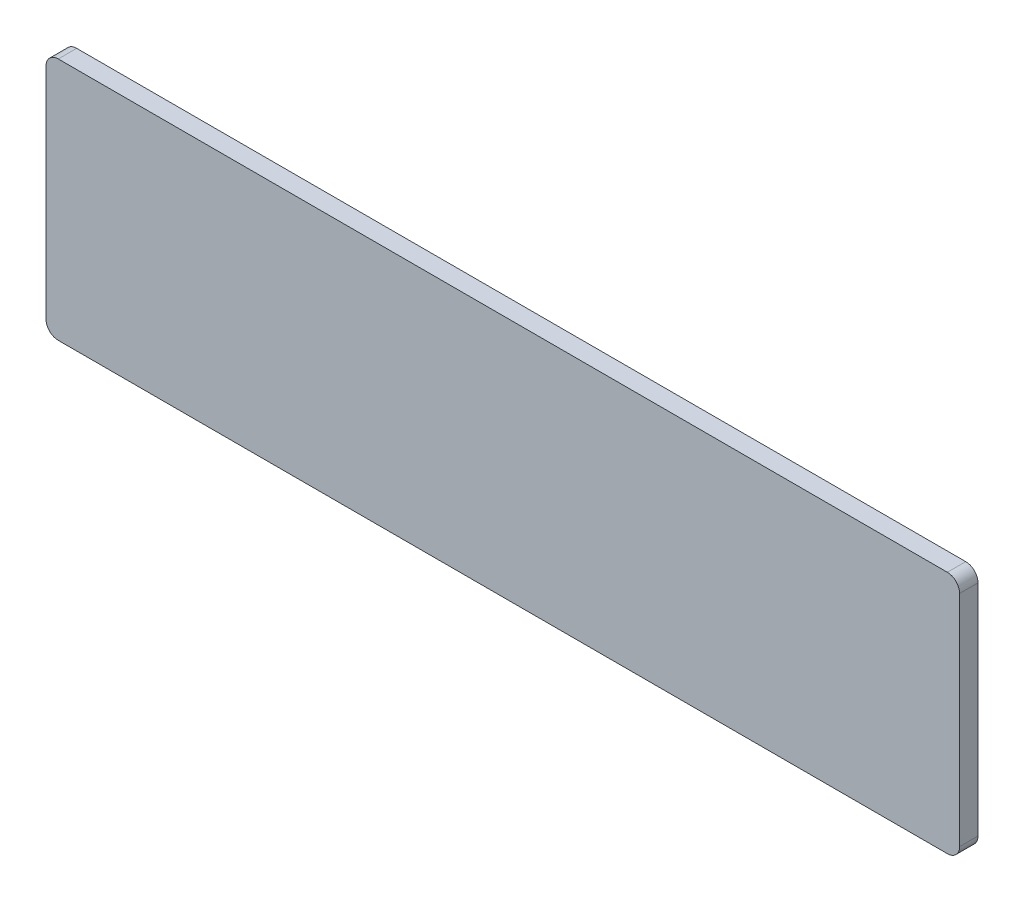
ISO-10303-21;
HEADER;
FILE_DESCRIPTION(('STEP AP214'),'2;1');
FILE_NAME('part.step','',(''),(''),'','','');
FILE_SCHEMA(('AUTOMOTIVE_DESIGN { 1 0 10303 214 1 1 1 1 }'));
ENDSEC;
DATA;
#1=APPLICATION_CONTEXT('core data for automotive mechanical design processes');
#2=APPLICATION_PROTOCOL_DEFINITION('international standard','automotive_design',2000,#1);
#3=PRODUCT_CONTEXT('',#1,'mechanical');
#4=PRODUCT('Part','Part','',(#3));
#5=PRODUCT_RELATED_PRODUCT_CATEGORY('part','',(#4));
#6=PRODUCT_DEFINITION_FORMATION('','',#4);
#7=PRODUCT_DEFINITION_CONTEXT('part definition',#1,'design');
#8=PRODUCT_DEFINITION('design','',#6,#7);
#9=PRODUCT_DEFINITION_SHAPE('','',#8);
#10=(LENGTH_UNIT() NAMED_UNIT(*) SI_UNIT(.MILLI.,.METRE.));
#11=(NAMED_UNIT(*) PLANE_ANGLE_UNIT() SI_UNIT($,.RADIAN.));
#12=(NAMED_UNIT(*) SI_UNIT($,.STERADIAN.) SOLID_ANGLE_UNIT());
#13=UNCERTAINTY_MEASURE_WITH_UNIT(LENGTH_MEASURE(1.E-05),#10,'distance_accuracy_value','');
#14=(GEOMETRIC_REPRESENTATION_CONTEXT(3) GLOBAL_UNCERTAINTY_ASSIGNED_CONTEXT((#13)) GLOBAL_UNIT_ASSIGNED_CONTEXT((#10,
#11,#12)) REPRESENTATION_CONTEXT('',''));
#15=CARTESIAN_POINT('',(0.,0.,0.));
#16=DIRECTION('',(0.,0.,1.));
#17=DIRECTION('',(1.,0.,0.));
#18=AXIS2_PLACEMENT_3D('',#15,#16,#17);
#19=CARTESIAN_POINT('',(-74.5,-19.875,3.));
#20=DIRECTION('',(1.,0.,0.));
#21=DIRECTION('',(0.,0.,-1.));
#22=AXIS2_PLACEMENT_3D('',#19,#20,#21);
#23=PLANE('',#22);
#24=DIRECTION('',(0.,-1.,0.));
#25=VECTOR('',#24,1.);
#26=CARTESIAN_POINT('',(-74.5,-19.875,0.));
#27=LINE('',#26,#25);
#28=CARTESIAN_POINT('',(-74.5,17.875,0.));
#29=VERTEX_POINT('',#28);
#30=CARTESIAN_POINT('',(-74.5,-17.875,0.));
#31=VERTEX_POINT('',#30);
#32=EDGE_CURVE('E142',#29,#31,#27,.T.);
#33=ORIENTED_EDGE('',*,*,#32,.T.);
#34=DIRECTION('',(0.,0.,-1.));
#35=VECTOR('',#34,1.);
#36=CARTESIAN_POINT('',(-74.5,-17.875,3.));
#37=LINE('',#36,#35);
#38=CARTESIAN_POINT('',(-74.5,-17.875,3.));
#39=VERTEX_POINT('',#38);
#40=EDGE_CURVE('E116',#31,#39,#37,.F.);
#41=ORIENTED_EDGE('',*,*,#40,.T.);
#42=DIRECTION('',(0.,-1.,0.));
#43=VECTOR('',#42,1.);
#44=CARTESIAN_POINT('',(-74.5,-19.875,3.));
#45=LINE('',#44,#43);
#46=CARTESIAN_POINT('',(-74.5,17.875,3.));
#47=VERTEX_POINT('',#46);
#48=EDGE_CURVE('E154',#47,#39,#45,.T.);
#49=ORIENTED_EDGE('',*,*,#48,.F.);
#50=DIRECTION('',(0.,0.,-1.));
#51=VECTOR('',#50,1.);
#52=CARTESIAN_POINT('',(-74.5,17.875,3.));
#53=LINE('',#52,#51);
#54=EDGE_CURVE('E122',#47,#29,#53,.T.);
#55=ORIENTED_EDGE('',*,*,#54,.T.);
#56=EDGE_LOOP('',(#33,#41,#49,#55));
#57=FACE_BOUND('',#56,.T.);
#58=ADVANCED_FACE('F43',(#57),#23,.F.);
#59=CARTESIAN_POINT('',(74.5,-19.875,3.));
#60=DIRECTION('',(0.,1.,0.));
#61=DIRECTION('',(-1.,0.,0.));
#62=AXIS2_PLACEMENT_3D('',#59,#60,#61);
#63=PLANE('',#62);
#64=DIRECTION('',(1.,0.,0.));
#65=VECTOR('',#64,1.);
#66=CARTESIAN_POINT('',(74.5,-19.875,3.));
#67=LINE('',#66,#65);
#68=CARTESIAN_POINT('',(-72.5,-19.875,3.));
#69=VERTEX_POINT('',#68);
#70=CARTESIAN_POINT('',(72.5,-19.875,3.));
#71=VERTEX_POINT('',#70);
#72=EDGE_CURVE('E132',#69,#71,#67,.T.);
#73=ORIENTED_EDGE('',*,*,#72,.F.);
#74=DIRECTION('',(0.,0.,-1.));
#75=VECTOR('',#74,1.);
#76=CARTESIAN_POINT('',(-72.5,-19.875,3.));
#77=LINE('',#76,#75);
#78=CARTESIAN_POINT('',(-72.5,-19.875,0.));
#79=VERTEX_POINT('',#78);
#80=EDGE_CURVE('E115',#69,#79,#77,.T.);
#81=ORIENTED_EDGE('',*,*,#80,.T.);
#82=DIRECTION('',(1.,0.,0.));
#83=VECTOR('',#82,1.);
#84=CARTESIAN_POINT('',(74.5,-19.875,0.));
#85=LINE('',#84,#83);
#86=CARTESIAN_POINT('',(72.5,-19.875,0.));
#87=VERTEX_POINT('',#86);
#88=EDGE_CURVE('E129',#79,#87,#85,.T.);
#89=ORIENTED_EDGE('',*,*,#88,.T.);
#90=DIRECTION('',(0.,0.,-1.));
#91=VECTOR('',#90,1.);
#92=CARTESIAN_POINT('',(72.5,-19.875,3.));
#93=LINE('',#92,#91);
#94=EDGE_CURVE('E135',#87,#71,#93,.F.);
#95=ORIENTED_EDGE('',*,*,#94,.T.);
#96=EDGE_LOOP('',(#73,#81,#89,#95));
#97=FACE_BOUND('',#96,.T.);
#98=ADVANCED_FACE('F128',(#97),#63,.F.);
#99=CARTESIAN_POINT('',(74.5,-19.875,3.));
#100=DIRECTION('',(-1.,0.,0.));
#101=DIRECTION('',(0.,0.,1.));
#102=AXIS2_PLACEMENT_3D('',#99,#100,#101);
#103=PLANE('',#102);
#104=DIRECTION('',(0.,1.,0.));
#105=VECTOR('',#104,1.);
#106=CARTESIAN_POINT('',(74.5,-19.875,3.));
#107=LINE('',#106,#105);
#108=CARTESIAN_POINT('',(74.5,-17.875,3.));
#109=VERTEX_POINT('',#108);
#110=CARTESIAN_POINT('',(74.5,17.875,3.));
#111=VERTEX_POINT('',#110);
#112=EDGE_CURVE('E190',#109,#111,#107,.T.);
#113=ORIENTED_EDGE('',*,*,#112,.F.);
#114=DIRECTION('',(0.,0.,-1.));
#115=VECTOR('',#114,1.);
#116=CARTESIAN_POINT('',(74.5,-17.875,3.));
#117=LINE('',#116,#115);
#118=CARTESIAN_POINT('',(74.5,-17.875,0.));
#119=VERTEX_POINT('',#118);
#120=EDGE_CURVE('E11',#109,#119,#117,.T.);
#121=ORIENTED_EDGE('',*,*,#120,.T.);
#122=DIRECTION('',(0.,1.,0.));
#123=VECTOR('',#122,1.);
#124=CARTESIAN_POINT('',(74.5,-19.875,0.));
#125=LINE('',#124,#123);
#126=CARTESIAN_POINT('',(74.5,17.875,0.));
#127=VERTEX_POINT('',#126);
#128=EDGE_CURVE('E141',#119,#127,#125,.T.);
#129=ORIENTED_EDGE('',*,*,#128,.T.);
#130=DIRECTION('',(0.,0.,-1.));
#131=VECTOR('',#130,1.);
#132=CARTESIAN_POINT('',(74.5,17.875,3.));
#133=LINE('',#132,#131);
#134=EDGE_CURVE('E52',#127,#111,#133,.F.);
#135=ORIENTED_EDGE('',*,*,#134,.T.);
#136=EDGE_LOOP('',(#113,#121,#129,#135));
#137=FACE_BOUND('',#136,.T.);
#138=ADVANCED_FACE('F189',(#137),#103,.F.);
#139=CARTESIAN_POINT('',(74.5,19.875,3.));
#140=DIRECTION('',(0.,-1.,0.));
#141=DIRECTION('',(1.,0.,0.));
#142=AXIS2_PLACEMENT_3D('',#139,#140,#141);
#143=PLANE('',#142);
#144=DIRECTION('',(-1.,0.,0.));
#145=VECTOR('',#144,1.);
#146=CARTESIAN_POINT('',(74.5,19.875,0.));
#147=LINE('',#146,#145);
#148=CARTESIAN_POINT('',(72.5,19.875,0.));
#149=VERTEX_POINT('',#148);
#150=CARTESIAN_POINT('',(-72.5,19.875,0.));
#151=VERTEX_POINT('',#150);
#152=EDGE_CURVE('E147',#149,#151,#147,.T.);
#153=ORIENTED_EDGE('',*,*,#152,.T.);
#154=DIRECTION('',(0.,0.,-1.));
#155=VECTOR('',#154,1.);
#156=CARTESIAN_POINT('',(-72.5,19.875,3.));
#157=LINE('',#156,#155);
#158=CARTESIAN_POINT('',(-72.5,19.875,3.));
#159=VERTEX_POINT('',#158);
#160=EDGE_CURVE('E59',#151,#159,#157,.F.);
#161=ORIENTED_EDGE('',*,*,#160,.T.);
#162=DIRECTION('',(-1.,0.,0.));
#163=VECTOR('',#162,1.);
#164=CARTESIAN_POINT('',(74.5,19.875,3.));
#165=LINE('',#164,#163);
#166=CARTESIAN_POINT('',(72.5,19.875,3.));
#167=VERTEX_POINT('',#166);
#168=EDGE_CURVE('E156',#167,#159,#165,.T.);
#169=ORIENTED_EDGE('',*,*,#168,.F.);
#170=DIRECTION('',(0.,0.,-1.));
#171=VECTOR('',#170,1.);
#172=CARTESIAN_POINT('',(72.5,19.875,3.));
#173=LINE('',#172,#171);
#174=EDGE_CURVE('E180',#167,#149,#173,.T.);
#175=ORIENTED_EDGE('',*,*,#174,.T.);
#176=EDGE_LOOP('',(#153,#161,#169,#175));
#177=FACE_BOUND('',#176,.T.);
#178=ADVANCED_FACE('F200',(#177),#143,.F.);
#179=CARTESIAN_POINT('',(0.,0.,3.));
#180=DIRECTION('',(0.,0.,1.));
#181=DIRECTION('',(1.,0.,0.));
#182=AXIS2_PLACEMENT_3D('',#179,#180,#181);
#183=PLANE('',#182);
#184=ORIENTED_EDGE('',*,*,#48,.T.);
#185=CARTESIAN_POINT('',(-72.5,-17.875,3.));
#186=DIRECTION('',(0.,0.,1.));
#187=DIRECTION('',(1.,0.,0.));
#188=AXIS2_PLACEMENT_3D('',#185,#186,#187);
#189=CIRCLE('',#188,2.);
#190=EDGE_CURVE('E177',#39,#69,#189,.T.);
#191=ORIENTED_EDGE('',*,*,#190,.T.);
#192=ORIENTED_EDGE('',*,*,#72,.T.);
#193=CARTESIAN_POINT('',(72.5,-17.875,3.));
#194=DIRECTION('',(0.,0.,1.));
#195=DIRECTION('',(1.,0.,0.));
#196=AXIS2_PLACEMENT_3D('',#193,#194,#195);
#197=CIRCLE('',#196,2.);
#198=EDGE_CURVE('E171',#71,#109,#197,.T.);
#199=ORIENTED_EDGE('',*,*,#198,.T.);
#200=ORIENTED_EDGE('',*,*,#112,.T.);
#201=CARTESIAN_POINT('',(72.5,17.875,3.));
#202=DIRECTION('',(0.,0.,1.));
#203=DIRECTION('',(1.,0.,0.));
#204=AXIS2_PLACEMENT_3D('',#201,#202,#203);
#205=CIRCLE('',#204,2.);
#206=EDGE_CURVE('E66',#111,#167,#205,.T.);
#207=ORIENTED_EDGE('',*,*,#206,.T.);
#208=ORIENTED_EDGE('',*,*,#168,.T.);
#209=CARTESIAN_POINT('',(-72.5,17.875,3.));
#210=DIRECTION('',(0.,0.,1.));
#211=DIRECTION('',(1.,0.,0.));
#212=AXIS2_PLACEMENT_3D('',#209,#210,#211);
#213=CIRCLE('',#212,2.);
#214=EDGE_CURVE('E174',#159,#47,#213,.T.);
#215=ORIENTED_EDGE('',*,*,#214,.T.);
#216=EDGE_LOOP('',(#184,#191,#192,#199,#200,#207,#208,#215));
#217=FACE_BOUND('',#216,.T.);
#218=ADVANCED_FACE('F194',(#217),#183,.T.);
#219=CARTESIAN_POINT('',(0.,0.,0.));
#220=DIRECTION('',(0.,0.,1.));
#221=DIRECTION('',(1.,0.,0.));
#222=AXIS2_PLACEMENT_3D('',#219,#220,#221);
#223=PLANE('',#222);
#224=ORIENTED_EDGE('',*,*,#88,.F.);
#225=CARTESIAN_POINT('',(-72.5,-17.875,0.));
#226=DIRECTION('',(0.,0.,1.));
#227=DIRECTION('',(1.,0.,0.));
#228=AXIS2_PLACEMENT_3D('',#225,#226,#227);
#229=CIRCLE('',#228,2.);
#230=EDGE_CURVE('E111',#79,#31,#229,.F.);
#231=ORIENTED_EDGE('',*,*,#230,.T.);
#232=ORIENTED_EDGE('',*,*,#32,.F.);
#233=CARTESIAN_POINT('',(-72.5,17.875,0.));
#234=DIRECTION('',(0.,0.,1.));
#235=DIRECTION('',(1.,0.,0.));
#236=AXIS2_PLACEMENT_3D('',#233,#234,#235);
#237=CIRCLE('',#236,2.);
#238=EDGE_CURVE('E123',#29,#151,#237,.F.);
#239=ORIENTED_EDGE('',*,*,#238,.T.);
#240=ORIENTED_EDGE('',*,*,#152,.F.);
#241=CARTESIAN_POINT('',(72.5,17.875,0.));
#242=DIRECTION('',(0.,0.,1.));
#243=DIRECTION('',(1.,0.,0.));
#244=AXIS2_PLACEMENT_3D('',#241,#242,#243);
#245=CIRCLE('',#244,2.);
#246=EDGE_CURVE('E134',#149,#127,#245,.F.);
#247=ORIENTED_EDGE('',*,*,#246,.T.);
#248=ORIENTED_EDGE('',*,*,#128,.F.);
#249=CARTESIAN_POINT('',(72.5,-17.875,0.));
#250=DIRECTION('',(0.,0.,1.));
#251=DIRECTION('',(1.,0.,0.));
#252=AXIS2_PLACEMENT_3D('',#249,#250,#251);
#253=CIRCLE('',#252,2.);
#254=EDGE_CURVE('E139',#119,#87,#253,.F.);
#255=ORIENTED_EDGE('',*,*,#254,.T.);
#256=EDGE_LOOP('',(#224,#231,#232,#239,#240,#247,#248,#255));
#257=FACE_BOUND('',#256,.T.);
#258=ADVANCED_FACE('F137',(#257),#223,.F.);
#259=CARTESIAN_POINT('',(-72.5,-17.875,3.));
#260=DIRECTION('',(0.,0.,-1.));
#261=DIRECTION('',(-1.,0.,0.));
#262=AXIS2_PLACEMENT_3D('',#259,#260,#261);
#263=CYLINDRICAL_SURFACE('',#262,2.);
#264=ORIENTED_EDGE('',*,*,#190,.F.);
#265=ORIENTED_EDGE('',*,*,#40,.F.);
#266=ORIENTED_EDGE('',*,*,#230,.F.);
#267=ORIENTED_EDGE('',*,*,#80,.F.);
#268=EDGE_LOOP('',(#264,#265,#266,#267));
#269=FACE_BOUND('',#268,.T.);
#270=ADVANCED_FACE('F114',(#269),#263,.T.);
#271=CARTESIAN_POINT('',(-72.5,17.875,3.));
#272=DIRECTION('',(0.,0.,-1.));
#273=DIRECTION('',(-1.,0.,0.));
#274=AXIS2_PLACEMENT_3D('',#271,#272,#273);
#275=CYLINDRICAL_SURFACE('',#274,2.);
#276=ORIENTED_EDGE('',*,*,#214,.F.);
#277=ORIENTED_EDGE('',*,*,#160,.F.);
#278=ORIENTED_EDGE('',*,*,#238,.F.);
#279=ORIENTED_EDGE('',*,*,#54,.F.);
#280=EDGE_LOOP('',(#276,#277,#278,#279));
#281=FACE_BOUND('',#280,.T.);
#282=ADVANCED_FACE('F204',(#281),#275,.T.);
#283=CARTESIAN_POINT('',(72.5,-17.875,3.));
#284=DIRECTION('',(0.,0.,-1.));
#285=DIRECTION('',(-1.,0.,0.));
#286=AXIS2_PLACEMENT_3D('',#283,#284,#285);
#287=CYLINDRICAL_SURFACE('',#286,2.);
#288=ORIENTED_EDGE('',*,*,#198,.F.);
#289=ORIENTED_EDGE('',*,*,#94,.F.);
#290=ORIENTED_EDGE('',*,*,#254,.F.);
#291=ORIENTED_EDGE('',*,*,#120,.F.);
#292=EDGE_LOOP('',(#288,#289,#290,#291));
#293=FACE_BOUND('',#292,.T.);
#294=ADVANCED_FACE('F213',(#293),#287,.T.);
#295=CARTESIAN_POINT('',(72.5,17.875,3.));
#296=DIRECTION('',(0.,0.,-1.));
#297=DIRECTION('',(-1.,0.,0.));
#298=AXIS2_PLACEMENT_3D('',#295,#296,#297);
#299=CYLINDRICAL_SURFACE('',#298,2.);
#300=ORIENTED_EDGE('',*,*,#206,.F.);
#301=ORIENTED_EDGE('',*,*,#134,.F.);
#302=ORIENTED_EDGE('',*,*,#246,.F.);
#303=ORIENTED_EDGE('',*,*,#174,.F.);
#304=EDGE_LOOP('',(#300,#301,#302,#303));
#305=FACE_BOUND('',#304,.T.);
#306=ADVANCED_FACE('F45',(#305),#299,.T.);
#307=CLOSED_SHELL('',(#58,#98,#138,#178,#218,#258,#270,#282,#294,#306));
#308=MANIFOLD_SOLID_BREP('B2',#307);
#309=ADVANCED_BREP_SHAPE_REPRESENTATION('',(#18,#308),#14);
#310=SHAPE_DEFINITION_REPRESENTATION(#9,#309);
ENDSEC;
END-ISO-10303-21;
